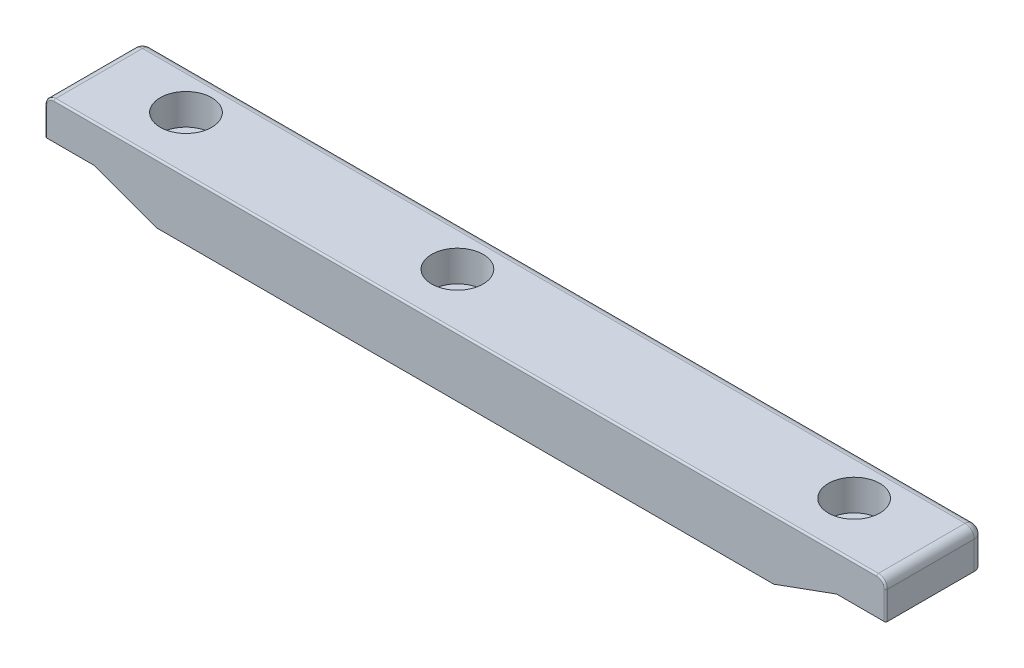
ISO-10303-21;
HEADER;
FILE_DESCRIPTION(('STEP AP214'),'2;1');
FILE_NAME('part.step','',(''),(''),'','','');
FILE_SCHEMA(('AUTOMOTIVE_DESIGN { 1 0 10303 214 1 1 1 1 }'));
ENDSEC;
DATA;
#1=APPLICATION_CONTEXT('core data for automotive mechanical design processes');
#2=APPLICATION_PROTOCOL_DEFINITION('international standard','automotive_design',2000,#1);
#3=PRODUCT_CONTEXT('',#1,'mechanical');
#4=PRODUCT('Part','Part','',(#3));
#5=PRODUCT_RELATED_PRODUCT_CATEGORY('part','',(#4));
#6=PRODUCT_DEFINITION_FORMATION('','',#4);
#7=PRODUCT_DEFINITION_CONTEXT('part definition',#1,'design');
#8=PRODUCT_DEFINITION('design','',#6,#7);
#9=PRODUCT_DEFINITION_SHAPE('','',#8);
#10=(LENGTH_UNIT() NAMED_UNIT(*) SI_UNIT(.MILLI.,.METRE.));
#11=(NAMED_UNIT(*) PLANE_ANGLE_UNIT() SI_UNIT($,.RADIAN.));
#12=(NAMED_UNIT(*) SI_UNIT($,.STERADIAN.) SOLID_ANGLE_UNIT());
#13=UNCERTAINTY_MEASURE_WITH_UNIT(LENGTH_MEASURE(1.E-05),#10,'distance_accuracy_value','');
#14=(GEOMETRIC_REPRESENTATION_CONTEXT(3) GLOBAL_UNCERTAINTY_ASSIGNED_CONTEXT((#13)) GLOBAL_UNIT_ASSIGNED_CONTEXT((#10,
#11,#12)) REPRESENTATION_CONTEXT('',''));
#15=CARTESIAN_POINT('',(0.,0.,0.));
#16=DIRECTION('',(0.,0.,1.));
#17=DIRECTION('',(1.,0.,0.));
#18=AXIS2_PLACEMENT_3D('',#15,#16,#17);
#19=CARTESIAN_POINT('',(-58.4,29.,7.5));
#20=DIRECTION('',(0.,1.,0.));
#21=DIRECTION('',(0.,0.,1.));
#22=AXIS2_PLACEMENT_3D('',#19,#20,#21);
#23=CYLINDRICAL_SURFACE('',#22,4.5);
#24=CARTESIAN_POINT('',(-58.4,23.6,7.5));
#25=DIRECTION('',(0.,1.,0.));
#26=DIRECTION('',(0.,0.,1.));
#27=AXIS2_PLACEMENT_3D('',#24,#25,#26);
#28=CIRCLE('',#27,4.5);
#29=CARTESIAN_POINT('',(-58.4,23.6,12.));
#30=VERTEX_POINT('',#29);
#31=EDGE_CURVE('E10',#30,#30,#28,.T.);
#32=ORIENTED_EDGE('',*,*,#31,.F.);
#33=EDGE_LOOP('',(#32));
#34=FACE_BOUND('',#33,.T.);
#35=CARTESIAN_POINT('',(-58.4,29.,7.5));
#36=DIRECTION('',(0.,1.,0.));
#37=DIRECTION('',(0.,0.,1.));
#38=AXIS2_PLACEMENT_3D('',#35,#36,#37);
#39=CIRCLE('',#38,4.5);
#40=CARTESIAN_POINT('',(-58.4,29.,12.));
#41=VERTEX_POINT('',#40);
#42=EDGE_CURVE('E271',#41,#41,#39,.T.);
#43=ORIENTED_EDGE('',*,*,#42,.T.);
#44=EDGE_LOOP('',(#43));
#45=FACE_BOUND('',#44,.T.);
#46=ADVANCED_FACE('F15',(#34,#45),#23,.F.);
#47=CARTESIAN_POINT('',(-55.65,23.6,7.5));
#48=DIRECTION('',(0.,-1.,0.));
#49=DIRECTION('',(0.,0.,-1.));
#50=AXIS2_PLACEMENT_3D('',#47,#48,#49);
#51=PLANE('',#50);
#52=CARTESIAN_POINT('',(-58.4,23.6,7.5));
#53=DIRECTION('',(0.,1.,0.));
#54=DIRECTION('',(0.,0.,1.));
#55=AXIS2_PLACEMENT_3D('',#52,#53,#54);
#56=CIRCLE('',#55,2.75);
#57=CARTESIAN_POINT('',(-58.4,23.6,10.25));
#58=VERTEX_POINT('',#57);
#59=EDGE_CURVE('E23',#58,#58,#56,.T.);
#60=ORIENTED_EDGE('',*,*,#59,.F.);
#61=EDGE_LOOP('',(#60));
#62=FACE_BOUND('',#61,.T.);
#63=ORIENTED_EDGE('',*,*,#31,.T.);
#64=EDGE_LOOP('',(#63));
#65=FACE_BOUND('',#64,.T.);
#66=ADVANCED_FACE('F408',(#62,#65),#51,.F.);
#67=CARTESIAN_POINT('',(-58.4,29.,7.5));
#68=DIRECTION('',(0.,1.,0.));
#69=DIRECTION('',(0.,0.,1.));
#70=AXIS2_PLACEMENT_3D('',#67,#68,#69);
#71=CYLINDRICAL_SURFACE('',#70,2.75);
#72=ORIENTED_EDGE('',*,*,#59,.T.);
#73=EDGE_LOOP('',(#72));
#74=FACE_BOUND('',#73,.T.);
#75=CARTESIAN_POINT('',(-61.15,21.1493931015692,7.5));
#76=CARTESIAN_POINT('',(-61.15,21.1493931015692,13.));
#77=CARTESIAN_POINT('',(-55.65,19.1475568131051,13.));
#78=CARTESIAN_POINT('',(-55.65,19.1475568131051,7.5));
#79=CARTESIAN_POINT('',(-55.65,19.1475568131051,2.00000000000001));
#80=CARTESIAN_POINT('',(-61.15,21.1493931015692,2.00000000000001));
#81=CARTESIAN_POINT('',(-61.15,21.1493931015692,7.5));
#82=(BOUNDED_CURVE() B_SPLINE_CURVE(3,(#75,#76,#77,#78,#79,#80,#81),.UNSPECIFIED.,.T.,
.F.) B_SPLINE_CURVE_WITH_KNOTS((4,3,4),(0.,3.1415926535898,6.28318530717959),
.UNSPECIFIED.) CURVE() GEOMETRIC_REPRESENTATION_ITEM() RATIONAL_B_SPLINE_CURVE((1.,
0.333333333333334,0.333333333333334,1.,0.333333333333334,0.333333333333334,1.)) REPRESENTATION_ITEM(''));
#83=CARTESIAN_POINT('',(-61.15,21.1493931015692,7.5));
#84=VERTEX_POINT('',#83);
#85=EDGE_CURVE('E213',#84,#84,#82,.T.);
#86=ORIENTED_EDGE('',*,*,#85,.F.);
#87=EDGE_LOOP('',(#86));
#88=FACE_BOUND('',#87,.T.);
#89=ADVANCED_FACE('F405',(#74,#88),#71,.F.);
#90=CARTESIAN_POINT('',(-10.95,29.,7.5));
#91=DIRECTION('',(0.,1.,0.));
#92=DIRECTION('',(0.,0.,1.));
#93=AXIS2_PLACEMENT_3D('',#90,#91,#92);
#94=CYLINDRICAL_SURFACE('',#93,4.5);
#95=CARTESIAN_POINT('',(-10.95,23.6,7.5));
#96=DIRECTION('',(0.,1.,0.));
#97=DIRECTION('',(0.,0.,1.));
#98=AXIS2_PLACEMENT_3D('',#95,#96,#97);
#99=CIRCLE('',#98,4.5);
#100=CARTESIAN_POINT('',(-10.95,23.6,12.));
#101=VERTEX_POINT('',#100);
#102=EDGE_CURVE('E219',#101,#101,#99,.T.);
#103=ORIENTED_EDGE('',*,*,#102,.F.);
#104=EDGE_LOOP('',(#103));
#105=FACE_BOUND('',#104,.T.);
#106=CARTESIAN_POINT('',(-10.95,29.,7.5));
#107=DIRECTION('',(0.,1.,0.));
#108=DIRECTION('',(0.,0.,1.));
#109=AXIS2_PLACEMENT_3D('',#106,#107,#108);
#110=CIRCLE('',#109,4.5);
#111=CARTESIAN_POINT('',(-10.95,29.,12.));
#112=VERTEX_POINT('',#111);
#113=EDGE_CURVE('E247',#112,#112,#110,.T.);
#114=ORIENTED_EDGE('',*,*,#113,.T.);
#115=EDGE_LOOP('',(#114));
#116=FACE_BOUND('',#115,.T.);
#117=ADVANCED_FACE('F407',(#105,#116),#94,.F.);
#118=CARTESIAN_POINT('',(-8.2,23.6,7.5));
#119=DIRECTION('',(0.,-1.,0.));
#120=DIRECTION('',(0.,0.,-1.));
#121=AXIS2_PLACEMENT_3D('',#118,#119,#120);
#122=PLANE('',#121);
#123=CARTESIAN_POINT('',(-10.95,23.6,7.5));
#124=DIRECTION('',(0.,1.,0.));
#125=DIRECTION('',(0.,0.,1.));
#126=AXIS2_PLACEMENT_3D('',#123,#124,#125);
#127=CIRCLE('',#126,2.75);
#128=CARTESIAN_POINT('',(-10.95,23.6,10.25));
#129=VERTEX_POINT('',#128);
#130=EDGE_CURVE('E222',#129,#129,#127,.T.);
#131=ORIENTED_EDGE('',*,*,#130,.F.);
#132=EDGE_LOOP('',(#131));
#133=FACE_BOUND('',#132,.T.);
#134=ORIENTED_EDGE('',*,*,#102,.T.);
#135=EDGE_LOOP('',(#134));
#136=FACE_BOUND('',#135,.T.);
#137=ADVANCED_FACE('F415',(#133,#136),#122,.F.);
#138=CARTESIAN_POINT('',(-10.95,29.,7.5));
#139=DIRECTION('',(0.,1.,0.));
#140=DIRECTION('',(0.,0.,1.));
#141=AXIS2_PLACEMENT_3D('',#138,#139,#140);
#142=CYLINDRICAL_SURFACE('',#141,2.75);
#143=ORIENTED_EDGE('',*,*,#130,.T.);
#144=EDGE_LOOP('',(#143));
#145=FACE_BOUND('',#144,.T.);
#146=CARTESIAN_POINT('',(-10.95,18.51,7.5));
#147=DIRECTION('',(0.,1.,0.));
#148=DIRECTION('',(0.,0.,1.));
#149=AXIS2_PLACEMENT_3D('',#146,#147,#148);
#150=CIRCLE('',#149,2.75);
#151=CARTESIAN_POINT('',(-10.95,18.51,10.25));
#152=VERTEX_POINT('',#151);
#153=EDGE_CURVE('E199',#152,#152,#150,.T.);
#154=ORIENTED_EDGE('',*,*,#153,.F.);
#155=EDGE_LOOP('',(#154));
#156=FACE_BOUND('',#155,.T.);
#157=ADVANCED_FACE('F590',(#145,#156),#142,.F.);
#158=CARTESIAN_POINT('',(58.4,29.,7.5));
#159=DIRECTION('',(0.,1.,0.));
#160=DIRECTION('',(0.,0.,1.));
#161=AXIS2_PLACEMENT_3D('',#158,#159,#160);
#162=CYLINDRICAL_SURFACE('',#161,4.5);
#163=CARTESIAN_POINT('',(58.4,23.6,7.5));
#164=DIRECTION('',(0.,1.,0.));
#165=DIRECTION('',(0.,0.,1.));
#166=AXIS2_PLACEMENT_3D('',#163,#164,#165);
#167=CIRCLE('',#166,4.5);
#168=CARTESIAN_POINT('',(58.4,23.6,12.));
#169=VERTEX_POINT('',#168);
#170=EDGE_CURVE('E217',#169,#169,#167,.T.);
#171=ORIENTED_EDGE('',*,*,#170,.F.);
#172=EDGE_LOOP('',(#171));
#173=FACE_BOUND('',#172,.T.);
#174=CARTESIAN_POINT('',(58.4,29.,7.5));
#175=DIRECTION('',(0.,1.,0.));
#176=DIRECTION('',(0.,0.,1.));
#177=AXIS2_PLACEMENT_3D('',#174,#175,#176);
#178=CIRCLE('',#177,4.5);
#179=CARTESIAN_POINT('',(58.4,29.,12.));
#180=VERTEX_POINT('',#179);
#181=EDGE_CURVE('E243',#180,#180,#178,.T.);
#182=ORIENTED_EDGE('',*,*,#181,.T.);
#183=EDGE_LOOP('',(#182));
#184=FACE_BOUND('',#183,.T.);
#185=ADVANCED_FACE('F586',(#173,#184),#162,.F.);
#186=CARTESIAN_POINT('',(61.15,23.6,7.5));
#187=DIRECTION('',(0.,-1.,0.));
#188=DIRECTION('',(0.,0.,-1.));
#189=AXIS2_PLACEMENT_3D('',#186,#187,#188);
#190=PLANE('',#189);
#191=CARTESIAN_POINT('',(58.4,23.6,7.5));
#192=DIRECTION('',(0.,1.,0.));
#193=DIRECTION('',(0.,0.,1.));
#194=AXIS2_PLACEMENT_3D('',#191,#192,#193);
#195=CIRCLE('',#194,2.75);
#196=CARTESIAN_POINT('',(58.4,23.6,10.25));
#197=VERTEX_POINT('',#196);
#198=EDGE_CURVE('E211',#197,#197,#195,.T.);
#199=ORIENTED_EDGE('',*,*,#198,.F.);
#200=EDGE_LOOP('',(#199));
#201=FACE_BOUND('',#200,.T.);
#202=ORIENTED_EDGE('',*,*,#170,.T.);
#203=EDGE_LOOP('',(#202));
#204=FACE_BOUND('',#203,.T.);
#205=ADVANCED_FACE('F582',(#201,#204),#190,.F.);
#206=CARTESIAN_POINT('',(58.4,29.,7.5));
#207=DIRECTION('',(0.,1.,0.));
#208=DIRECTION('',(0.,0.,1.));
#209=AXIS2_PLACEMENT_3D('',#206,#207,#208);
#210=CYLINDRICAL_SURFACE('',#209,2.75);
#211=ORIENTED_EDGE('',*,*,#198,.T.);
#212=EDGE_LOOP('',(#211));
#213=FACE_BOUND('',#212,.T.);
#214=CARTESIAN_POINT('',(61.15,21.1493931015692,7.5));
#215=CARTESIAN_POINT('',(61.15,21.1493931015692,2.));
#216=CARTESIAN_POINT('',(55.65,19.1475568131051,2.));
#217=CARTESIAN_POINT('',(55.65,19.1475568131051,7.5));
#218=CARTESIAN_POINT('',(55.65,19.1475568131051,13.));
#219=CARTESIAN_POINT('',(61.15,21.1493931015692,13.));
#220=CARTESIAN_POINT('',(61.15,21.1493931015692,7.5));
#221=(BOUNDED_CURVE() B_SPLINE_CURVE(3,(#214,#215,#216,#217,#218,#219,#220),.UNSPECIFIED.,.T.,
.F.) B_SPLINE_CURVE_WITH_KNOTS((4,3,4),(0.,3.1415926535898,6.28318530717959),
.UNSPECIFIED.) CURVE() GEOMETRIC_REPRESENTATION_ITEM() RATIONAL_B_SPLINE_CURVE((1.,
0.333333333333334,0.333333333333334,1.,0.333333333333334,0.333333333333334,1.)) REPRESENTATION_ITEM(''));
#222=CARTESIAN_POINT('',(61.15,21.1493931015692,7.5));
#223=VERTEX_POINT('',#222);
#224=EDGE_CURVE('E204',#223,#223,#221,.T.);
#225=ORIENTED_EDGE('',*,*,#224,.F.);
#226=EDGE_LOOP('',(#225));
#227=FACE_BOUND('',#226,.T.);
#228=ADVANCED_FACE('F578',(#213,#227),#210,.F.);
#229=CARTESIAN_POINT('',(64.8865797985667,22.5093969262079,17.05));
#230=DIRECTION('',(-0.342020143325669,0.939692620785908,0.));
#231=DIRECTION('',(0.,0.,1.));
#232=AXIS2_PLACEMENT_3D('',#229,#230,#231);
#233=PLANE('',#232);
#234=ORIENTED_EDGE('',*,*,#224,.T.);
#235=EDGE_LOOP('',(#234));
#236=FACE_BOUND('',#235,.T.);
#237=DIRECTION('',(0.939692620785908,0.342020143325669,0.));
#238=VECTOR('',#237,1.);
#239=CARTESIAN_POINT('',(64.8865797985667,22.5093969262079,0.));
#240=LINE('',#239,#238);
#241=CARTESIAN_POINT('',(53.8983270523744,18.51,0.));
#242=VERTEX_POINT('',#241);
#243=CARTESIAN_POINT('',(64.8882367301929,22.51,0.));
#244=VERTEX_POINT('',#243);
#245=EDGE_CURVE('E328',#242,#244,#240,.T.);
#246=ORIENTED_EDGE('',*,*,#245,.T.);
#247=DIRECTION('',(0.,0.,-1.));
#248=VECTOR('',#247,1.);
#249=CARTESIAN_POINT('',(64.8882367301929,22.51,17.05));
#250=LINE('',#249,#248);
#251=CARTESIAN_POINT('',(64.8882367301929,22.51,17.05));
#252=VERTEX_POINT('',#251);
#253=EDGE_CURVE('E292',#252,#244,#250,.T.);
#254=ORIENTED_EDGE('',*,*,#253,.F.);
#255=DIRECTION('',(0.939692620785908,0.342020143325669,0.));
#256=VECTOR('',#255,1.);
#257=CARTESIAN_POINT('',(64.8865797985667,22.5093969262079,17.05));
#258=LINE('',#257,#256);
#259=CARTESIAN_POINT('',(53.8983270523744,18.51,17.05));
#260=VERTEX_POINT('',#259);
#261=EDGE_CURVE('E246',#260,#252,#258,.T.);
#262=ORIENTED_EDGE('',*,*,#261,.F.);
#263=DIRECTION('',(0.,0.,-1.));
#264=VECTOR('',#263,1.);
#265=CARTESIAN_POINT('',(53.8983270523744,18.51,17.05));
#266=LINE('',#265,#264);
#267=EDGE_CURVE('E205',#260,#242,#266,.T.);
#268=ORIENTED_EDGE('',*,*,#267,.T.);
#269=EDGE_LOOP('',(#246,#254,#262,#268));
#270=FACE_BOUND('',#269,.T.);
#271=ADVANCED_FACE('F494',(#236,#270),#233,.F.);
#272=CARTESIAN_POINT('',(53.9000903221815,18.51,17.05));
#273=DIRECTION('',(0.,1.,0.));
#274=DIRECTION('',(1.,0.,0.));
#275=AXIS2_PLACEMENT_3D('',#272,#273,#274);
#276=PLANE('',#275);
#277=ORIENTED_EDGE('',*,*,#153,.T.);
#278=EDGE_LOOP('',(#277));
#279=FACE_BOUND('',#278,.T.);
#280=DIRECTION('',(1.,0.,0.));
#281=VECTOR('',#280,1.);
#282=CARTESIAN_POINT('',(53.9000903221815,18.51,0.));
#283=LINE('',#282,#281);
#284=CARTESIAN_POINT('',(-53.8983270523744,18.51,0.));
#285=VERTEX_POINT('',#284);
#286=EDGE_CURVE('E332',#285,#242,#283,.T.);
#287=ORIENTED_EDGE('',*,*,#286,.T.);
#288=ORIENTED_EDGE('',*,*,#267,.F.);
#289=DIRECTION('',(1.,0.,0.));
#290=VECTOR('',#289,1.);
#291=CARTESIAN_POINT('',(53.9000903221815,18.51,17.05));
#292=LINE('',#291,#290);
#293=CARTESIAN_POINT('',(-53.8983270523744,18.51,17.05));
#294=VERTEX_POINT('',#293);
#295=EDGE_CURVE('E320',#294,#260,#292,.T.);
#296=ORIENTED_EDGE('',*,*,#295,.F.);
#297=DIRECTION('',(0.,0.,-1.));
#298=VECTOR('',#297,1.);
#299=CARTESIAN_POINT('',(-53.8983270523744,18.51,17.05));
#300=LINE('',#299,#298);
#301=EDGE_CURVE('E308',#294,#285,#300,.T.);
#302=ORIENTED_EDGE('',*,*,#301,.T.);
#303=EDGE_LOOP('',(#287,#288,#296,#302));
#304=FACE_BOUND('',#303,.T.);
#305=ADVANCED_FACE('F200',(#279,#304),#276,.F.);
#306=CARTESIAN_POINT('',(-64.8865797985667,22.5093969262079,17.05));
#307=DIRECTION('',(0.342020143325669,0.939692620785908,0.));
#308=DIRECTION('',(0.,0.,-1.));
#309=AXIS2_PLACEMENT_3D('',#306,#307,#308);
#310=PLANE('',#309);
#311=ORIENTED_EDGE('',*,*,#85,.T.);
#312=EDGE_LOOP('',(#311));
#313=FACE_BOUND('',#312,.T.);
#314=DIRECTION('',(0.939692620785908,-0.342020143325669,0.));
#315=VECTOR('',#314,1.);
#316=CARTESIAN_POINT('',(-64.8865797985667,22.5093969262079,0.));
#317=LINE('',#316,#315);
#318=CARTESIAN_POINT('',(-64.8882367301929,22.51,0.));
#319=VERTEX_POINT('',#318);
#320=EDGE_CURVE('E336',#319,#285,#317,.T.);
#321=ORIENTED_EDGE('',*,*,#320,.T.);
#322=ORIENTED_EDGE('',*,*,#301,.F.);
#323=DIRECTION('',(0.939692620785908,-0.342020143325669,0.));
#324=VECTOR('',#323,1.);
#325=CARTESIAN_POINT('',(-64.8865797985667,22.5093969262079,17.05));
#326=LINE('',#325,#324);
#327=CARTESIAN_POINT('',(-64.8882367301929,22.51,17.05));
#328=VERTEX_POINT('',#327);
#329=EDGE_CURVE('E316',#328,#294,#326,.T.);
#330=ORIENTED_EDGE('',*,*,#329,.F.);
#331=DIRECTION('',(0.,0.,-1.));
#332=VECTOR('',#331,1.);
#333=CARTESIAN_POINT('',(-64.8882367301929,22.51,17.05));
#334=LINE('',#333,#332);
#335=EDGE_CURVE('E305',#328,#319,#334,.T.);
#336=ORIENTED_EDGE('',*,*,#335,.T.);
#337=EDGE_LOOP('',(#321,#322,#330,#336));
#338=FACE_BOUND('',#337,.T.);
#339=ADVANCED_FACE('F402',(#313,#338),#310,.F.);
#340=CARTESIAN_POINT('',(-73.5,22.51,17.05));
#341=DIRECTION('',(0.,1.,0.));
#342=DIRECTION('',(1.,0.,0.));
#343=AXIS2_PLACEMENT_3D('',#340,#341,#342);
#344=PLANE('',#343);
#345=CARTESIAN_POINT('',(-71.9,22.51,1.6));
#346=DIRECTION('',(0.,-1.,0.));
#347=DIRECTION('',(0.,0.,1.));
#348=AXIS2_PLACEMENT_3D('',#345,#346,#347);
#349=CIRCLE('',#348,1.6);
#350=CARTESIAN_POINT('',(-73.5,22.51,1.6));
#351=VERTEX_POINT('',#350);
#352=CARTESIAN_POINT('',(-71.9,22.51,0.));
#353=VERTEX_POINT('',#352);
#354=EDGE_CURVE('E373',#351,#353,#349,.T.);
#355=ORIENTED_EDGE('',*,*,#354,.T.);
#356=DIRECTION('',(1.,0.,0.));
#357=VECTOR('',#356,1.);
#358=CARTESIAN_POINT('',(-73.5,22.51,0.));
#359=LINE('',#358,#357);
#360=EDGE_CURVE('E340',#353,#319,#359,.T.);
#361=ORIENTED_EDGE('',*,*,#360,.T.);
#362=ORIENTED_EDGE('',*,*,#335,.F.);
#363=DIRECTION('',(1.,0.,0.));
#364=VECTOR('',#363,1.);
#365=CARTESIAN_POINT('',(-73.5,22.51,17.05));
#366=LINE('',#365,#364);
#367=CARTESIAN_POINT('',(-73.2,22.51,17.05));
#368=VERTEX_POINT('',#367);
#369=EDGE_CURVE('E312',#368,#328,#366,.T.);
#370=ORIENTED_EDGE('',*,*,#369,.F.);
#371=CARTESIAN_POINT('',(-73.2,22.51,16.75));
#372=DIRECTION('',(0.,-1.,0.));
#373=DIRECTION('',(0.,0.,1.));
#374=AXIS2_PLACEMENT_3D('',#371,#372,#373);
#375=CIRCLE('',#374,0.3);
#376=CARTESIAN_POINT('',(-73.5,22.51,16.75));
#377=VERTEX_POINT('',#376);
#378=EDGE_CURVE('E382',#368,#377,#375,.T.);
#379=ORIENTED_EDGE('',*,*,#378,.T.);
#380=DIRECTION('',(0.,0.,-1.));
#381=VECTOR('',#380,1.);
#382=CARTESIAN_POINT('',(-73.5,22.51,17.05));
#383=LINE('',#382,#381);
#384=EDGE_CURVE('E434',#377,#351,#383,.T.);
#385=ORIENTED_EDGE('',*,*,#384,.T.);
#386=EDGE_LOOP('',(#355,#361,#362,#370,#379,#385));
#387=FACE_BOUND('',#386,.T.);
#388=ADVANCED_FACE('F520',(#387),#344,.F.);
#389=CARTESIAN_POINT('',(73.5,22.51,17.05));
#390=DIRECTION('',(0.,1.,0.));
#391=DIRECTION('',(1.,0.,0.));
#392=AXIS2_PLACEMENT_3D('',#389,#390,#391);
#393=PLANE('',#392);
#394=CARTESIAN_POINT('',(71.9,22.51,1.6));
#395=DIRECTION('',(0.,-1.,0.));
#396=DIRECTION('',(0.,0.,1.));
#397=AXIS2_PLACEMENT_3D('',#394,#395,#396);
#398=CIRCLE('',#397,1.6);
#399=CARTESIAN_POINT('',(71.9,22.51,0.));
#400=VERTEX_POINT('',#399);
#401=CARTESIAN_POINT('',(73.5,22.51,1.6));
#402=VERTEX_POINT('',#401);
#403=EDGE_CURVE('E379',#400,#402,#398,.T.);
#404=ORIENTED_EDGE('',*,*,#403,.T.);
#405=DIRECTION('',(0.,0.,-1.));
#406=VECTOR('',#405,1.);
#407=CARTESIAN_POINT('',(73.5,22.51,17.05));
#408=LINE('',#407,#406);
#409=CARTESIAN_POINT('',(73.5,22.51,16.75));
#410=VERTEX_POINT('',#409);
#411=EDGE_CURVE('E235',#410,#402,#408,.T.);
#412=ORIENTED_EDGE('',*,*,#411,.F.);
#413=CARTESIAN_POINT('',(73.2,22.51,16.75));
#414=DIRECTION('',(0.,-1.,0.));
#415=DIRECTION('',(0.,0.,1.));
#416=AXIS2_PLACEMENT_3D('',#413,#414,#415);
#417=CIRCLE('',#416,0.3);
#418=CARTESIAN_POINT('',(73.2,22.51,17.05));
#419=VERTEX_POINT('',#418);
#420=EDGE_CURVE('E275',#410,#419,#417,.T.);
#421=ORIENTED_EDGE('',*,*,#420,.T.);
#422=DIRECTION('',(1.,0.,0.));
#423=VECTOR('',#422,1.);
#424=CARTESIAN_POINT('',(73.5,22.51,17.05));
#425=LINE('',#424,#423);
#426=EDGE_CURVE('E280',#252,#419,#425,.T.);
#427=ORIENTED_EDGE('',*,*,#426,.F.);
#428=ORIENTED_EDGE('',*,*,#253,.T.);
#429=DIRECTION('',(1.,0.,0.));
#430=VECTOR('',#429,1.);
#431=CARTESIAN_POINT('',(73.5,22.51,0.));
#432=LINE('',#431,#430);
#433=EDGE_CURVE('E324',#244,#400,#432,.T.);
#434=ORIENTED_EDGE('',*,*,#433,.T.);
#435=EDGE_LOOP('',(#404,#412,#421,#427,#428,#434));
#436=FACE_BOUND('',#435,.T.);
#437=ADVANCED_FACE('F470',(#436),#393,.F.);
#438=CARTESIAN_POINT('',(71.9,27.4,16.75));
#439=DIRECTION('',(0.,0.,-1.));
#440=DIRECTION('',(-1.,0.,0.));
#441=AXIS2_PLACEMENT_3D('',#438,#439,#440);
#442=TOROIDAL_SURFACE('',#441,1.3,0.3);
#443=CARTESIAN_POINT('',(73.2,27.4,16.75));
#444=DIRECTION('',(0.,1.,0.));
#445=DIRECTION('',(0.,0.,1.));
#446=AXIS2_PLACEMENT_3D('',#443,#444,#445);
#447=CIRCLE('',#446,0.3);
#448=CARTESIAN_POINT('',(73.2,27.4,17.05));
#449=VERTEX_POINT('',#448);
#450=CARTESIAN_POINT('',(73.5,27.4,16.75));
#451=VERTEX_POINT('',#450);
#452=EDGE_CURVE('E278',#449,#451,#447,.T.);
#453=ORIENTED_EDGE('',*,*,#452,.T.);
#454=CARTESIAN_POINT('',(71.9,27.4,16.75));
#455=DIRECTION('',(0.,0.,-1.));
#456=DIRECTION('',(-1.,0.,0.));
#457=AXIS2_PLACEMENT_3D('',#454,#455,#456);
#458=CIRCLE('',#457,1.6);
#459=CARTESIAN_POINT('',(71.9,29.,16.75));
#460=VERTEX_POINT('',#459);
#461=EDGE_CURVE('E257',#460,#451,#458,.T.);
#462=ORIENTED_EDGE('',*,*,#461,.F.);
#463=CARTESIAN_POINT('',(71.9,28.7,16.75));
#464=DIRECTION('',(1.,0.,0.));
#465=DIRECTION('',(0.,0.,-1.));
#466=AXIS2_PLACEMENT_3D('',#463,#464,#465);
#467=CIRCLE('',#466,0.3);
#468=CARTESIAN_POINT('',(71.9,28.7,17.05));
#469=VERTEX_POINT('',#468);
#470=EDGE_CURVE('E289',#460,#469,#467,.T.);
#471=ORIENTED_EDGE('',*,*,#470,.T.);
#472=CARTESIAN_POINT('',(71.9,27.4,17.05));
#473=DIRECTION('',(0.,0.,1.));
#474=DIRECTION('',(-1.,0.,0.));
#475=AXIS2_PLACEMENT_3D('',#472,#473,#474);
#476=CIRCLE('',#475,1.3);
#477=EDGE_CURVE('E288',#449,#469,#476,.T.);
#478=ORIENTED_EDGE('',*,*,#477,.F.);
#479=EDGE_LOOP('',(#453,#462,#471,#478));
#480=FACE_BOUND('',#479,.T.);
#481=ADVANCED_FACE('F486',(#480),#442,.T.);
#482=CARTESIAN_POINT('',(0.,28.7,16.75));
#483=DIRECTION('',(-1.,0.,0.));
#484=DIRECTION('',(0.,-1.,0.));
#485=AXIS2_PLACEMENT_3D('',#482,#483,#484);
#486=CYLINDRICAL_SURFACE('',#485,0.3);
#487=CARTESIAN_POINT('',(-71.9,28.7,16.75));
#488=DIRECTION('',(1.,0.,0.));
#489=DIRECTION('',(0.,0.,-1.));
#490=AXIS2_PLACEMENT_3D('',#487,#488,#489);
#491=CIRCLE('',#490,0.3);
#492=CARTESIAN_POINT('',(-71.9,29.,16.75));
#493=VERTEX_POINT('',#492);
#494=CARTESIAN_POINT('',(-71.9,28.7,17.05));
#495=VERTEX_POINT('',#494);
#496=EDGE_CURVE('E279',#493,#495,#491,.T.);
#497=ORIENTED_EDGE('',*,*,#496,.T.);
#498=DIRECTION('',(-1.,0.,0.));
#499=VECTOR('',#498,1.);
#500=CARTESIAN_POINT('',(0.,28.7,17.05));
#501=LINE('',#500,#499);
#502=EDGE_CURVE('E296',#469,#495,#501,.T.);
#503=ORIENTED_EDGE('',*,*,#502,.F.);
#504=ORIENTED_EDGE('',*,*,#470,.F.);
#505=DIRECTION('',(1.,0.,0.));
#506=VECTOR('',#505,1.);
#507=CARTESIAN_POINT('',(73.5,29.,16.75));
#508=LINE('',#507,#506);
#509=EDGE_CURVE('E260',#493,#460,#508,.T.);
#510=ORIENTED_EDGE('',*,*,#509,.F.);
#511=EDGE_LOOP('',(#497,#503,#504,#510));
#512=FACE_BOUND('',#511,.T.);
#513=ADVANCED_FACE('F508',(#512),#486,.T.);
#514=CARTESIAN_POINT('',(73.2,0.,16.75));
#515=DIRECTION('',(0.,1.,0.));
#516=DIRECTION('',(-1.,0.,0.));
#517=AXIS2_PLACEMENT_3D('',#514,#515,#516);
#518=CYLINDRICAL_SURFACE('',#517,0.299999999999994);
#519=ORIENTED_EDGE('',*,*,#420,.F.);
#520=DIRECTION('',(0.,-1.,0.));
#521=VECTOR('',#520,1.);
#522=CARTESIAN_POINT('',(73.5,29.,16.75));
#523=LINE('',#522,#521);
#524=EDGE_CURVE('E233',#451,#410,#523,.T.);
#525=ORIENTED_EDGE('',*,*,#524,.F.);
#526=ORIENTED_EDGE('',*,*,#452,.F.);
#527=DIRECTION('',(0.,1.,0.));
#528=VECTOR('',#527,1.);
#529=CARTESIAN_POINT('',(73.2,0.,17.05));
#530=LINE('',#529,#528);
#531=EDGE_CURVE('E284',#419,#449,#530,.T.);
#532=ORIENTED_EDGE('',*,*,#531,.F.);
#533=EDGE_LOOP('',(#519,#525,#526,#532));
#534=FACE_BOUND('',#533,.T.);
#535=ADVANCED_FACE('F465',(#534),#518,.T.);
#536=CARTESIAN_POINT('',(-71.9,27.4,16.75));
#537=DIRECTION('',(0.,0.,-1.));
#538=DIRECTION('',(-1.,0.,0.));
#539=AXIS2_PLACEMENT_3D('',#536,#537,#538);
#540=TOROIDAL_SURFACE('',#539,1.3,0.3);
#541=CARTESIAN_POINT('',(-73.2,27.4,16.75));
#542=DIRECTION('',(0.,1.,0.));
#543=DIRECTION('',(0.,0.,1.));
#544=AXIS2_PLACEMENT_3D('',#541,#542,#543);
#545=CIRCLE('',#544,0.3);
#546=CARTESIAN_POINT('',(-73.5,27.4,16.75));
#547=VERTEX_POINT('',#546);
#548=CARTESIAN_POINT('',(-73.2,27.4,17.05));
#549=VERTEX_POINT('',#548);
#550=EDGE_CURVE('E385',#547,#549,#545,.T.);
#551=ORIENTED_EDGE('',*,*,#550,.T.);
#552=CARTESIAN_POINT('',(-71.9,27.4,17.05));
#553=DIRECTION('',(0.,0.,1.));
#554=DIRECTION('',(-1.,0.,0.));
#555=AXIS2_PLACEMENT_3D('',#552,#553,#554);
#556=CIRCLE('',#555,1.3);
#557=EDGE_CURVE('E300',#495,#549,#556,.T.);
#558=ORIENTED_EDGE('',*,*,#557,.F.);
#559=ORIENTED_EDGE('',*,*,#496,.F.);
#560=CARTESIAN_POINT('',(-71.9,27.4,16.75));
#561=DIRECTION('',(0.,0.,-1.));
#562=DIRECTION('',(-1.,0.,0.));
#563=AXIS2_PLACEMENT_3D('',#560,#561,#562);
#564=CIRCLE('',#563,1.6);
#565=EDGE_CURVE('E355',#547,#493,#564,.T.);
#566=ORIENTED_EDGE('',*,*,#565,.F.);
#567=EDGE_LOOP('',(#551,#558,#559,#566));
#568=FACE_BOUND('',#567,.T.);
#569=ADVANCED_FACE('F512',(#568),#540,.T.);
#570=CARTESIAN_POINT('',(-73.2,0.,16.75));
#571=DIRECTION('',(0.,-1.,0.));
#572=DIRECTION('',(1.,0.,0.));
#573=AXIS2_PLACEMENT_3D('',#570,#571,#572);
#574=CYLINDRICAL_SURFACE('',#573,0.299999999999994);
#575=ORIENTED_EDGE('',*,*,#378,.F.);
#576=DIRECTION('',(0.,-1.,0.));
#577=VECTOR('',#576,1.);
#578=CARTESIAN_POINT('',(-73.2,0.,17.05));
#579=LINE('',#578,#577);
#580=EDGE_CURVE('E304',#549,#368,#579,.T.);
#581=ORIENTED_EDGE('',*,*,#580,.F.);
#582=ORIENTED_EDGE('',*,*,#550,.F.);
#583=DIRECTION('',(0.,1.,0.));
#584=VECTOR('',#583,1.);
#585=CARTESIAN_POINT('',(-73.5,29.,16.75));
#586=LINE('',#585,#584);
#587=EDGE_CURVE('E437',#377,#547,#586,.T.);
#588=ORIENTED_EDGE('',*,*,#587,.F.);
#589=EDGE_LOOP('',(#575,#581,#582,#588));
#590=FACE_BOUND('',#589,.T.);
#591=ADVANCED_FACE('F516',(#590),#574,.T.);
#592=CARTESIAN_POINT('',(71.9,29.,1.6));
#593=DIRECTION('',(0.,-1.,0.));
#594=DIRECTION('',(1.,0.,0.));
#595=AXIS2_PLACEMENT_3D('',#592,#593,#594);
#596=CYLINDRICAL_SURFACE('',#595,1.6);
#597=ORIENTED_EDGE('',*,*,#403,.F.);
#598=DIRECTION('',(0.,-1.,0.));
#599=VECTOR('',#598,1.);
#600=CARTESIAN_POINT('',(71.9,-29.,0.));
#601=LINE('',#600,#599);
#602=CARTESIAN_POINT('',(71.9,27.4,0.));
#603=VERTEX_POINT('',#602);
#604=EDGE_CURVE('E349',#603,#400,#601,.T.);
#605=ORIENTED_EDGE('',*,*,#604,.F.);
#606=CARTESIAN_POINT('',(71.9,27.4,1.6));
#607=DIRECTION('',(0.,-1.,0.));
#608=DIRECTION('',(0.,0.,1.));
#609=AXIS2_PLACEMENT_3D('',#606,#607,#608);
#610=CIRCLE('',#609,1.6);
#611=CARTESIAN_POINT('',(73.5,27.4,1.6));
#612=VERTEX_POINT('',#611);
#613=EDGE_CURVE('E376',#603,#612,#610,.T.);
#614=ORIENTED_EDGE('',*,*,#613,.T.);
#615=DIRECTION('',(0.,1.,0.));
#616=VECTOR('',#615,1.);
#617=CARTESIAN_POINT('',(73.5,29.,1.6));
#618=LINE('',#617,#616);
#619=EDGE_CURVE('E238',#402,#612,#618,.T.);
#620=ORIENTED_EDGE('',*,*,#619,.F.);
#621=EDGE_LOOP('',(#597,#605,#614,#620));
#622=FACE_BOUND('',#621,.T.);
#623=ADVANCED_FACE('F475',(#622),#596,.T.);
#624=CARTESIAN_POINT('',(71.9,27.4,1.6));
#625=DIRECTION('',(0.,1.,0.));
#626=DIRECTION('',(1.,0.,0.));
#627=AXIS2_PLACEMENT_3D('',#624,#625,#626);
#628=SPHERICAL_SURFACE('',#627,1.6);
#629=CARTESIAN_POINT('',(71.9,27.4,1.6));
#630=DIRECTION('',(1.,0.,0.));
#631=DIRECTION('',(0.,0.,-1.));
#632=AXIS2_PLACEMENT_3D('',#629,#630,#631);
#633=CIRCLE('',#632,1.6);
#634=CARTESIAN_POINT('',(71.9,29.,1.6));
#635=VERTEX_POINT('',#634);
#636=EDGE_CURVE('E256',#603,#635,#633,.T.);
#637=ORIENTED_EDGE('',*,*,#636,.T.);
#638=CARTESIAN_POINT('',(71.9,27.4,1.6));
#639=DIRECTION('',(0.,0.,-1.));
#640=DIRECTION('',(-1.,0.,0.));
#641=AXIS2_PLACEMENT_3D('',#638,#639,#640);
#642=CIRCLE('',#641,1.6);
#643=EDGE_CURVE('E252',#635,#612,#642,.T.);
#644=ORIENTED_EDGE('',*,*,#643,.T.);
#645=ORIENTED_EDGE('',*,*,#613,.F.);
#646=EDGE_LOOP('',(#637,#644,#645));
#647=FACE_BOUND('',#646,.T.);
#648=ADVANCED_FACE('F479',(#647),#628,.T.);
#649=CARTESIAN_POINT('',(-71.9,29.,1.6));
#650=DIRECTION('',(0.,1.,0.));
#651=DIRECTION('',(-1.,0.,0.));
#652=AXIS2_PLACEMENT_3D('',#649,#650,#651);
#653=CYLINDRICAL_SURFACE('',#652,1.6);
#654=ORIENTED_EDGE('',*,*,#354,.F.);
#655=DIRECTION('',(0.,-1.,0.));
#656=VECTOR('',#655,1.);
#657=CARTESIAN_POINT('',(-73.5,-29.,1.6));
#658=LINE('',#657,#656);
#659=CARTESIAN_POINT('',(-73.5,27.4,1.6));
#660=VERTEX_POINT('',#659);
#661=EDGE_CURVE('E438',#660,#351,#658,.T.);
#662=ORIENTED_EDGE('',*,*,#661,.F.);
#663=CARTESIAN_POINT('',(-71.9,27.4,1.6));
#664=DIRECTION('',(0.,-1.,0.));
#665=DIRECTION('',(0.,0.,1.));
#666=AXIS2_PLACEMENT_3D('',#663,#664,#665);
#667=CIRCLE('',#666,1.6);
#668=CARTESIAN_POINT('',(-71.9,27.4,0.));
#669=VERTEX_POINT('',#668);
#670=EDGE_CURVE('E363',#660,#669,#667,.T.);
#671=ORIENTED_EDGE('',*,*,#670,.T.);
#672=DIRECTION('',(0.,1.,0.));
#673=VECTOR('',#672,1.);
#674=CARTESIAN_POINT('',(-71.9,29.,0.));
#675=LINE('',#674,#673);
#676=EDGE_CURVE('E341',#353,#669,#675,.T.);
#677=ORIENTED_EDGE('',*,*,#676,.F.);
#678=EDGE_LOOP('',(#654,#662,#671,#677));
#679=FACE_BOUND('',#678,.T.);
#680=ADVANCED_FACE('F538',(#679),#653,.T.);
#681=CARTESIAN_POINT('',(73.5,27.4,1.6));
#682=DIRECTION('',(1.,0.,0.));
#683=DIRECTION('',(0.,1.,0.));
#684=AXIS2_PLACEMENT_3D('',#681,#682,#683);
#685=CYLINDRICAL_SURFACE('',#684,1.6);
#686=CARTESIAN_POINT('',(-71.9,27.4,1.6));
#687=DIRECTION('',(1.,0.,0.));
#688=DIRECTION('',(0.,0.,1.));
#689=AXIS2_PLACEMENT_3D('',#686,#687,#688);
#690=CIRCLE('',#689,1.6);
#691=CARTESIAN_POINT('',(-71.9,29.,1.6));
#692=VERTEX_POINT('',#691);
#693=EDGE_CURVE('E367',#669,#692,#690,.T.);
#694=ORIENTED_EDGE('',*,*,#693,.T.);
#695=DIRECTION('',(-1.,0.,0.));
#696=VECTOR('',#695,1.);
#697=CARTESIAN_POINT('',(-73.5,29.,1.6));
#698=LINE('',#697,#696);
#699=EDGE_CURVE('E264',#635,#692,#698,.T.);
#700=ORIENTED_EDGE('',*,*,#699,.F.);
#701=ORIENTED_EDGE('',*,*,#636,.F.);
#702=DIRECTION('',(1.,0.,0.));
#703=VECTOR('',#702,1.);
#704=CARTESIAN_POINT('',(73.5,27.4,0.));
#705=LINE('',#704,#703);
#706=EDGE_CURVE('E345',#669,#603,#705,.T.);
#707=ORIENTED_EDGE('',*,*,#706,.F.);
#708=EDGE_LOOP('',(#694,#700,#701,#707));
#709=FACE_BOUND('',#708,.T.);
#710=ADVANCED_FACE('F502',(#709),#685,.T.);
#711=CARTESIAN_POINT('',(71.9,27.4,17.05));
#712=DIRECTION('',(0.,0.,-1.));
#713=DIRECTION('',(-1.,0.,0.));
#714=AXIS2_PLACEMENT_3D('',#711,#712,#713);
#715=CYLINDRICAL_SURFACE('',#714,1.6);
#716=DIRECTION('',(0.,0.,-1.));
#717=VECTOR('',#716,1.);
#718=CARTESIAN_POINT('',(71.9,29.,17.05));
#719=LINE('',#718,#717);
#720=EDGE_CURVE('E272',#460,#635,#719,.T.);
#721=ORIENTED_EDGE('',*,*,#720,.F.);
#722=ORIENTED_EDGE('',*,*,#461,.T.);
#723=DIRECTION('',(0.,0.,1.));
#724=VECTOR('',#723,1.);
#725=CARTESIAN_POINT('',(73.5,27.4,17.05));
#726=LINE('',#725,#724);
#727=EDGE_CURVE('E242',#612,#451,#726,.T.);
#728=ORIENTED_EDGE('',*,*,#727,.F.);
#729=ORIENTED_EDGE('',*,*,#643,.F.);
#730=EDGE_LOOP('',(#721,#722,#728,#729));
#731=FACE_BOUND('',#730,.T.);
#732=ADVANCED_FACE('F483',(#731),#715,.T.);
#733=CARTESIAN_POINT('',(-71.9,27.4,1.6));
#734=DIRECTION('',(0.,1.,0.));
#735=DIRECTION('',(1.,0.,0.));
#736=AXIS2_PLACEMENT_3D('',#733,#734,#735);
#737=SPHERICAL_SURFACE('',#736,1.6);
#738=ORIENTED_EDGE('',*,*,#670,.F.);
#739=CARTESIAN_POINT('',(-71.9,27.4,1.6));
#740=DIRECTION('',(0.,0.,-1.));
#741=DIRECTION('',(-1.,0.,0.));
#742=AXIS2_PLACEMENT_3D('',#739,#740,#741);
#743=CIRCLE('',#742,1.6);
#744=EDGE_CURVE('E359',#660,#692,#743,.T.);
#745=ORIENTED_EDGE('',*,*,#744,.T.);
#746=ORIENTED_EDGE('',*,*,#693,.F.);
#747=EDGE_LOOP('',(#738,#745,#746));
#748=FACE_BOUND('',#747,.T.);
#749=ADVANCED_FACE('F541',(#748),#737,.T.);
#750=CARTESIAN_POINT('',(-71.9,27.4,17.05));
#751=DIRECTION('',(0.,0.,-1.));
#752=DIRECTION('',(-1.,0.,0.));
#753=AXIS2_PLACEMENT_3D('',#750,#751,#752);
#754=CYLINDRICAL_SURFACE('',#753,1.6);
#755=DIRECTION('',(0.,0.,-1.));
#756=VECTOR('',#755,1.);
#757=CARTESIAN_POINT('',(-73.5,27.4,17.05));
#758=LINE('',#757,#756);
#759=EDGE_CURVE('E447',#547,#660,#758,.T.);
#760=ORIENTED_EDGE('',*,*,#759,.F.);
#761=ORIENTED_EDGE('',*,*,#565,.T.);
#762=DIRECTION('',(0.,0.,1.));
#763=VECTOR('',#762,1.);
#764=CARTESIAN_POINT('',(-71.9,29.,17.05));
#765=LINE('',#764,#763);
#766=EDGE_CURVE('E251',#692,#493,#765,.T.);
#767=ORIENTED_EDGE('',*,*,#766,.F.);
#768=ORIENTED_EDGE('',*,*,#744,.F.);
#769=EDGE_LOOP('',(#760,#761,#767,#768));
#770=FACE_BOUND('',#769,.T.);
#771=ADVANCED_FACE('F543',(#770),#754,.T.);
#772=CARTESIAN_POINT('',(0.,0.,0.));
#773=DIRECTION('',(0.,0.,-1.));
#774=DIRECTION('',(0.,-1.,0.));
#775=AXIS2_PLACEMENT_3D('',#772,#773,#774);
#776=PLANE('',#775);
#777=ORIENTED_EDGE('',*,*,#433,.F.);
#778=ORIENTED_EDGE('',*,*,#245,.F.);
#779=ORIENTED_EDGE('',*,*,#286,.F.);
#780=ORIENTED_EDGE('',*,*,#320,.F.);
#781=ORIENTED_EDGE('',*,*,#360,.F.);
#782=ORIENTED_EDGE('',*,*,#676,.T.);
#783=ORIENTED_EDGE('',*,*,#706,.T.);
#784=ORIENTED_EDGE('',*,*,#604,.T.);
#785=EDGE_LOOP('',(#777,#778,#779,#780,#781,#782,#783,#784));
#786=FACE_BOUND('',#785,.T.);
#787=ADVANCED_FACE('F497',(#786),#776,.T.);
#788=CARTESIAN_POINT('',(0.,0.,17.05));
#789=DIRECTION('',(0.,0.,-1.));
#790=DIRECTION('',(0.,-1.,0.));
#791=AXIS2_PLACEMENT_3D('',#788,#789,#790);
#792=PLANE('',#791);
#793=ORIENTED_EDGE('',*,*,#261,.T.);
#794=ORIENTED_EDGE('',*,*,#426,.T.);
#795=ORIENTED_EDGE('',*,*,#531,.T.);
#796=ORIENTED_EDGE('',*,*,#477,.T.);
#797=ORIENTED_EDGE('',*,*,#502,.T.);
#798=ORIENTED_EDGE('',*,*,#557,.T.);
#799=ORIENTED_EDGE('',*,*,#580,.T.);
#800=ORIENTED_EDGE('',*,*,#369,.T.);
#801=ORIENTED_EDGE('',*,*,#329,.T.);
#802=ORIENTED_EDGE('',*,*,#295,.T.);
#803=EDGE_LOOP('',(#793,#794,#795,#796,#797,#798,#799,#800,#801,#802));
#804=FACE_BOUND('',#803,.T.);
#805=ADVANCED_FACE('F490',(#804),#792,.F.);
#806=CARTESIAN_POINT('',(73.5,29.,17.05));
#807=DIRECTION('',(0.,-1.,0.));
#808=DIRECTION('',(0.,0.,-1.));
#809=AXIS2_PLACEMENT_3D('',#806,#807,#808);
#810=PLANE('',#809);
#811=ORIENTED_EDGE('',*,*,#181,.F.);
#812=EDGE_LOOP('',(#811));
#813=FACE_BOUND('',#812,.T.);
#814=ORIENTED_EDGE('',*,*,#113,.F.);
#815=EDGE_LOOP('',(#814));
#816=FACE_BOUND('',#815,.T.);
#817=ORIENTED_EDGE('',*,*,#42,.F.);
#818=EDGE_LOOP('',(#817));
#819=FACE_BOUND('',#818,.T.);
#820=ORIENTED_EDGE('',*,*,#766,.T.);
#821=ORIENTED_EDGE('',*,*,#509,.T.);
#822=ORIENTED_EDGE('',*,*,#720,.T.);
#823=ORIENTED_EDGE('',*,*,#699,.T.);
#824=EDGE_LOOP('',(#820,#821,#822,#823));
#825=FACE_BOUND('',#824,.T.);
#826=ADVANCED_FACE('F505',(#813,#816,#819,#825),#810,.F.);
#827=CARTESIAN_POINT('',(73.5,29.,17.05));
#828=DIRECTION('',(-1.,0.,0.));
#829=DIRECTION('',(0.,1.,0.));
#830=AXIS2_PLACEMENT_3D('',#827,#828,#829);
#831=PLANE('',#830);
#832=ORIENTED_EDGE('',*,*,#524,.T.);
#833=ORIENTED_EDGE('',*,*,#411,.T.);
#834=ORIENTED_EDGE('',*,*,#619,.T.);
#835=ORIENTED_EDGE('',*,*,#727,.T.);
#836=EDGE_LOOP('',(#832,#833,#834,#835));
#837=FACE_BOUND('',#836,.T.);
#838=ADVANCED_FACE('F461',(#837),#831,.F.);
#839=CARTESIAN_POINT('',(-73.5,29.,17.05));
#840=DIRECTION('',(1.,0.,0.));
#841=DIRECTION('',(0.,1.,0.));
#842=AXIS2_PLACEMENT_3D('',#839,#840,#841);
#843=PLANE('',#842);
#844=ORIENTED_EDGE('',*,*,#661,.T.);
#845=ORIENTED_EDGE('',*,*,#384,.F.);
#846=ORIENTED_EDGE('',*,*,#587,.T.);
#847=ORIENTED_EDGE('',*,*,#759,.T.);
#848=EDGE_LOOP('',(#844,#845,#846,#847));
#849=FACE_BOUND('',#848,.T.);
#850=ADVANCED_FACE('F536',(#849),#843,.F.);
#851=CLOSED_SHELL('',(#46,#66,#89,#117,#137,#157,#185,#205,#228,#271,#305,#339,#388,#437,#481,
#513,#535,#569,#591,#623,#648,#680,#710,#732,#749,#771,#787,#805,#826,#838,#850));
#852=MANIFOLD_SOLID_BREP('B1',#851);
#853=ADVANCED_BREP_SHAPE_REPRESENTATION('',(#18,#852),#14);
#854=SHAPE_DEFINITION_REPRESENTATION(#9,#853);
ENDSEC;
END-ISO-10303-21;
